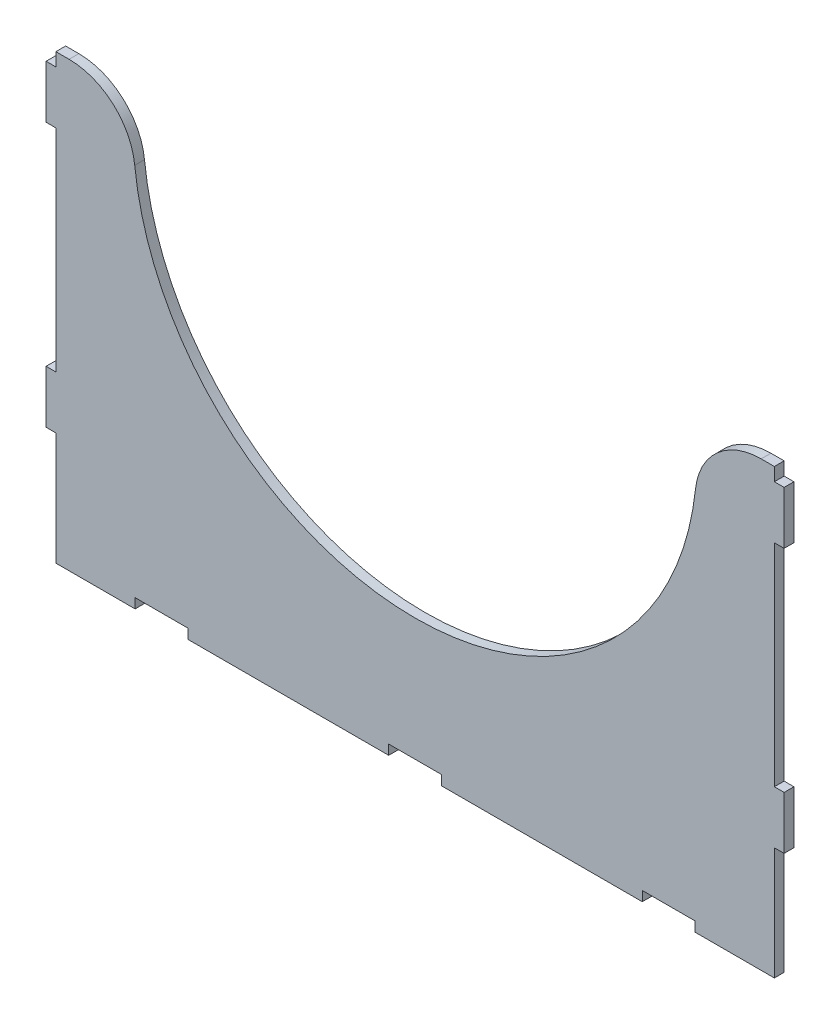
from build123d import *

# Parameters (mm, degrees)
BOSS_EXTRUDE1_DEPTH = 3.7


with BuildPart() as part:
    # Sketch1 → Boss-Extrude1 (new body)
    with BuildSketch(Plane.XY):
        with BuildLine():
            Line((106, 0), (136, 0))
            Line((136, 0), (136, 42.7))
            Line((136, 42.7), (139.7, 42.7))
            Line((139.7, 42.7), (139.7, 62.7))
            Line((139.7, 62.7), (136, 62.7))
            Line((136, 62.7), (136, 142.7))
            Line((136, 142.7), (139.7, 142.7))
            Line((139.7, 142.7), (139.7, 162.7))
            Line((139.7, 162.7), (136, 162.7))
            Line((136, 162.7), (136, 167.7))
            Line((136, 167.7), (131, 167.7))
            ThreePointArc((131, 167.7), (114.291573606, 161.29646438), (106.142587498, 145.366278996))
            ThreePointArc((106.142587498, 145.366278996), (0, 50), (-106.142587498, 145.366278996))
            ThreePointArc((-106.142587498, 145.366278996), (-114.291573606, 161.29646438), (-131, 167.7))
            Line((-131, 167.7), (-136, 167.7))
            Line((-136, 167.7), (-136, 162.7))
            Line((-136, 162.7), (-139.7, 162.7))
            Line((-139.7, 162.7), (-139.7, 142.7))
            Line((-139.7, 142.7), (-136, 142.7))
            Line((-136, 142.7), (-136, 62.7))
            Line((-136, 62.7), (-139.7, 62.7))
            Line((-139.7, 62.7), (-139.7, 42.7))
            Line((-139.7, 42.7), (-136, 42.7))
            Line((-136, 42.7), (-136, 0))
            Line((-136, 0), (-106, 0))
            Line((-106, 0), (-106, 3.7))
            Line((-106, 3.7), (-86, 3.7))
            Line((-86, 3.7), (-86, 0))
            Line((-86, 0), (-10, 0))
            Line((-10, 0), (-10, 3.7))
            Line((-10, 3.7), (10, 3.7))
            Line((10, 3.7), (10, 0))
            Line((10, 0), (86, 0))
            Line((86, 0), (86, 3.7))
            Line((86, 3.7), (106, 3.7))
            Line((106, 3.7), (106, 0))
        make_face()
    extrude(amount=BOSS_EXTRUDE1_DEPTH)


solid = part.part
